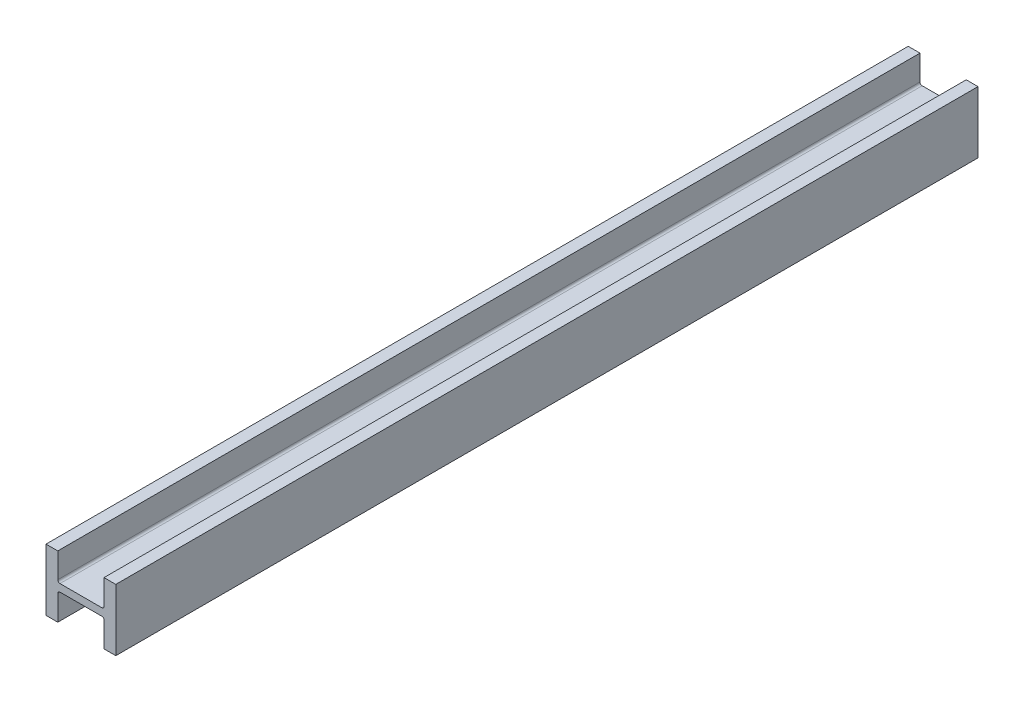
ISO-10303-21;
HEADER;
FILE_DESCRIPTION(('STEP AP214'),'2;1');
FILE_NAME('part.step','',(''),(''),'','','');
FILE_SCHEMA(('AUTOMOTIVE_DESIGN { 1 0 10303 214 1 1 1 1 }'));
ENDSEC;
DATA;
#1=APPLICATION_CONTEXT('core data for automotive mechanical design processes');
#2=APPLICATION_PROTOCOL_DEFINITION('international standard','automotive_design',2000,#1);
#3=PRODUCT_CONTEXT('',#1,'mechanical');
#4=PRODUCT('Part','Part','',(#3));
#5=PRODUCT_RELATED_PRODUCT_CATEGORY('part','',(#4));
#6=PRODUCT_DEFINITION_FORMATION('','',#4);
#7=PRODUCT_DEFINITION_CONTEXT('part definition',#1,'design');
#8=PRODUCT_DEFINITION('design','',#6,#7);
#9=PRODUCT_DEFINITION_SHAPE('','',#8);
#10=(LENGTH_UNIT() NAMED_UNIT(*) SI_UNIT(.MILLI.,.METRE.));
#11=(NAMED_UNIT(*) PLANE_ANGLE_UNIT() SI_UNIT($,.RADIAN.));
#12=(NAMED_UNIT(*) SI_UNIT($,.STERADIAN.) SOLID_ANGLE_UNIT());
#13=UNCERTAINTY_MEASURE_WITH_UNIT(LENGTH_MEASURE(1.E-05),#10,'distance_accuracy_value','');
#14=(GEOMETRIC_REPRESENTATION_CONTEXT(3) GLOBAL_UNCERTAINTY_ASSIGNED_CONTEXT((#13)) GLOBAL_UNIT_ASSIGNED_CONTEXT((#10,
#11,#12)) REPRESENTATION_CONTEXT('',''));
#15=CARTESIAN_POINT('',(0.,0.,0.));
#16=DIRECTION('',(0.,0.,1.));
#17=DIRECTION('',(1.,0.,0.));
#18=AXIS2_PLACEMENT_3D('',#15,#16,#17);
#19=CARTESIAN_POINT('',(241.554,213.8045,2984.5));
#20=DIRECTION('',(-1.,0.,0.));
#21=DIRECTION('',(0.,0.,1.));
#22=AXIS2_PLACEMENT_3D('',#19,#20,#21);
#23=PLANE('',#22);
#24=DIRECTION('',(0.,1.,0.));
#25=VECTOR('',#24,1.);
#26=CARTESIAN_POINT('',(241.554,213.8045,-2984.5));
#27=LINE('',#26,#25);
#28=CARTESIAN_POINT('',(241.554,-213.8045,-2984.5));
#29=VERTEX_POINT('',#28);
#30=CARTESIAN_POINT('',(241.554,213.8045,-2984.5));
#31=VERTEX_POINT('',#30);
#32=EDGE_CURVE('E192',#29,#31,#27,.T.);
#33=ORIENTED_EDGE('',*,*,#32,.T.);
#34=DIRECTION('',(0.,0.,-1.));
#35=VECTOR('',#34,1.);
#36=CARTESIAN_POINT('',(241.554,213.8045,2984.5));
#37=LINE('',#36,#35);
#38=CARTESIAN_POINT('',(241.554,213.8045,2984.5));
#39=VERTEX_POINT('',#38);
#40=EDGE_CURVE('E11',#39,#31,#37,.T.);
#41=ORIENTED_EDGE('',*,*,#40,.F.);
#42=DIRECTION('',(0.,1.,0.));
#43=VECTOR('',#42,1.);
#44=CARTESIAN_POINT('',(241.554,213.8045,2984.5));
#45=LINE('',#44,#43);
#46=CARTESIAN_POINT('',(241.554,-213.8045,2984.5));
#47=VERTEX_POINT('',#46);
#48=EDGE_CURVE('E238',#47,#39,#45,.T.);
#49=ORIENTED_EDGE('',*,*,#48,.F.);
#50=DIRECTION('',(0.,0.,-1.));
#51=VECTOR('',#50,1.);
#52=CARTESIAN_POINT('',(241.554,-213.8045,2984.5));
#53=LINE('',#52,#51);
#54=EDGE_CURVE('E186',#47,#29,#53,.T.);
#55=ORIENTED_EDGE('',*,*,#54,.T.);
#56=EDGE_LOOP('',(#33,#41,#49,#55));
#57=FACE_BOUND('',#56,.T.);
#58=ADVANCED_FACE('F44',(#57),#23,.F.);
#59=CARTESIAN_POINT('',(160.02,213.8045,2984.5));
#60=DIRECTION('',(0.,-1.,0.));
#61=DIRECTION('',(0.,0.,-1.));
#62=AXIS2_PLACEMENT_3D('',#59,#60,#61);
#63=PLANE('',#62);
#64=DIRECTION('',(-1.,0.,0.));
#65=VECTOR('',#64,1.);
#66=CARTESIAN_POINT('',(160.02,213.8045,-2984.5));
#67=LINE('',#66,#65);
#68=CARTESIAN_POINT('',(160.02,213.8045,-2984.5));
#69=VERTEX_POINT('',#68);
#70=EDGE_CURVE('E196',#31,#69,#67,.T.);
#71=ORIENTED_EDGE('',*,*,#70,.T.);
#72=DIRECTION('',(0.,0.,-1.));
#73=VECTOR('',#72,1.);
#74=CARTESIAN_POINT('',(160.02,213.8045,2984.5));
#75=LINE('',#74,#73);
#76=CARTESIAN_POINT('',(160.02,213.8045,2984.5));
#77=VERTEX_POINT('',#76);
#78=EDGE_CURVE('E53',#77,#69,#75,.T.);
#79=ORIENTED_EDGE('',*,*,#78,.F.);
#80=DIRECTION('',(-1.,0.,0.));
#81=VECTOR('',#80,1.);
#82=CARTESIAN_POINT('',(160.02,213.8045,2984.5));
#83=LINE('',#82,#81);
#84=EDGE_CURVE('E129',#39,#77,#83,.T.);
#85=ORIENTED_EDGE('',*,*,#84,.F.);
#86=ORIENTED_EDGE('',*,*,#40,.T.);
#87=EDGE_LOOP('',(#71,#79,#85,#86));
#88=FACE_BOUND('',#87,.T.);
#89=ADVANCED_FACE('F362',(#88),#63,.F.);
#90=CARTESIAN_POINT('',(160.02,40.8305000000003,2984.5));
#91=DIRECTION('',(1.,0.,0.));
#92=DIRECTION('',(0.,0.,-1.));
#93=AXIS2_PLACEMENT_3D('',#90,#91,#92);
#94=PLANE('',#93);
#95=DIRECTION('',(0.,-1.,0.));
#96=VECTOR('',#95,1.);
#97=CARTESIAN_POINT('',(160.02,40.8305000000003,-2984.5));
#98=LINE('',#97,#96);
#99=CARTESIAN_POINT('',(160.02,40.8305000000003,-2984.5));
#100=VERTEX_POINT('',#99);
#101=EDGE_CURVE('E203',#69,#100,#98,.T.);
#102=ORIENTED_EDGE('',*,*,#101,.T.);
#103=DIRECTION('',(0.,0.,-1.));
#104=VECTOR('',#103,1.);
#105=CARTESIAN_POINT('',(160.02,40.8305000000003,2984.5));
#106=LINE('',#105,#104);
#107=CARTESIAN_POINT('',(160.02,40.8305000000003,2984.5));
#108=VERTEX_POINT('',#107);
#109=EDGE_CURVE('E282',#108,#100,#106,.T.);
#110=ORIENTED_EDGE('',*,*,#109,.F.);
#111=DIRECTION('',(0.,-1.,0.));
#112=VECTOR('',#111,1.);
#113=CARTESIAN_POINT('',(160.02,40.8305000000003,2984.5));
#114=LINE('',#113,#112);
#115=EDGE_CURVE('E291',#77,#108,#114,.T.);
#116=ORIENTED_EDGE('',*,*,#115,.F.);
#117=ORIENTED_EDGE('',*,*,#78,.T.);
#118=EDGE_LOOP('',(#102,#110,#116,#117));
#119=FACE_BOUND('',#118,.T.);
#120=ADVANCED_FACE('F292',(#119),#94,.F.);
#121=CARTESIAN_POINT('',(144.78,40.8305000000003,2984.5));
#122=DIRECTION('',(0.,0.,-1.));
#123=DIRECTION('',(-1.,0.,0.));
#124=AXIS2_PLACEMENT_3D('',#121,#122,#123);
#125=CYLINDRICAL_SURFACE('',#124,15.24);
#126=CARTESIAN_POINT('',(144.78,40.8305000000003,-2984.5));
#127=DIRECTION('',(0.,0.,-1.));
#128=DIRECTION('',(1.,0.,0.));
#129=AXIS2_PLACEMENT_3D('',#126,#127,#128);
#130=CIRCLE('',#129,15.24);
#131=CARTESIAN_POINT('',(144.78,25.5905000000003,-2984.5));
#132=VERTEX_POINT('',#131);
#133=EDGE_CURVE('E204',#100,#132,#130,.T.);
#134=ORIENTED_EDGE('',*,*,#133,.T.);
#135=DIRECTION('',(0.,0.,-1.));
#136=VECTOR('',#135,1.);
#137=CARTESIAN_POINT('',(144.78,25.5905000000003,2984.5));
#138=LINE('',#137,#136);
#139=CARTESIAN_POINT('',(144.78,25.5905000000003,2984.5));
#140=VERTEX_POINT('',#139);
#141=EDGE_CURVE('E276',#140,#132,#138,.T.);
#142=ORIENTED_EDGE('',*,*,#141,.F.);
#143=CARTESIAN_POINT('',(144.78,40.8305000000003,2984.5));
#144=DIRECTION('',(0.,0.,-1.));
#145=DIRECTION('',(1.,0.,0.));
#146=AXIS2_PLACEMENT_3D('',#143,#144,#145);
#147=CIRCLE('',#146,15.24);
#148=EDGE_CURVE('E315',#108,#140,#147,.T.);
#149=ORIENTED_EDGE('',*,*,#148,.F.);
#150=ORIENTED_EDGE('',*,*,#109,.T.);
#151=EDGE_LOOP('',(#134,#142,#149,#150));
#152=FACE_BOUND('',#151,.T.);
#153=ADVANCED_FACE('F305',(#152),#125,.F.);
#154=CARTESIAN_POINT('',(-144.78,25.5905000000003,2984.5));
#155=DIRECTION('',(0.,-1.,0.));
#156=DIRECTION('',(1.,0.,0.));
#157=AXIS2_PLACEMENT_3D('',#154,#155,#156);
#158=PLANE('',#157);
#159=DIRECTION('',(-1.,0.,0.));
#160=VECTOR('',#159,1.);
#161=CARTESIAN_POINT('',(-144.78,25.5905000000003,-2984.5));
#162=LINE('',#161,#160);
#163=CARTESIAN_POINT('',(-144.78,25.5905000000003,-2984.5));
#164=VERTEX_POINT('',#163);
#165=EDGE_CURVE('E210',#132,#164,#162,.T.);
#166=ORIENTED_EDGE('',*,*,#165,.T.);
#167=DIRECTION('',(0.,0.,-1.));
#168=VECTOR('',#167,1.);
#169=CARTESIAN_POINT('',(-144.78,25.5905000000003,2984.5));
#170=LINE('',#169,#168);
#171=CARTESIAN_POINT('',(-144.78,25.5905000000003,2984.5));
#172=VERTEX_POINT('',#171);
#173=EDGE_CURVE('E274',#172,#164,#170,.T.);
#174=ORIENTED_EDGE('',*,*,#173,.F.);
#175=DIRECTION('',(-1.,0.,0.));
#176=VECTOR('',#175,1.);
#177=CARTESIAN_POINT('',(-144.78,25.5905000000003,2984.5));
#178=LINE('',#177,#176);
#179=EDGE_CURVE('E306',#140,#172,#178,.T.);
#180=ORIENTED_EDGE('',*,*,#179,.F.);
#181=ORIENTED_EDGE('',*,*,#141,.T.);
#182=EDGE_LOOP('',(#166,#174,#180,#181));
#183=FACE_BOUND('',#182,.T.);
#184=ADVANCED_FACE('F308',(#183),#158,.F.);
#185=CARTESIAN_POINT('',(-144.78,40.8305000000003,2984.5));
#186=DIRECTION('',(0.,0.,-1.));
#187=DIRECTION('',(-1.,0.,0.));
#188=AXIS2_PLACEMENT_3D('',#185,#186,#187);
#189=CYLINDRICAL_SURFACE('',#188,15.24);
#190=CARTESIAN_POINT('',(-144.78,40.8305000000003,-2984.5));
#191=DIRECTION('',(0.,0.,-1.));
#192=DIRECTION('',(1.,0.,0.));
#193=AXIS2_PLACEMENT_3D('',#190,#191,#192);
#194=CIRCLE('',#193,15.24);
#195=CARTESIAN_POINT('',(-160.02,40.8305000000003,-2984.5));
#196=VERTEX_POINT('',#195);
#197=EDGE_CURVE('E209',#164,#196,#194,.T.);
#198=ORIENTED_EDGE('',*,*,#197,.T.);
#199=DIRECTION('',(0.,0.,-1.));
#200=VECTOR('',#199,1.);
#201=CARTESIAN_POINT('',(-160.02,40.8305000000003,2984.5));
#202=LINE('',#201,#200);
#203=CARTESIAN_POINT('',(-160.02,40.8305000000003,2984.5));
#204=VERTEX_POINT('',#203);
#205=EDGE_CURVE('E271',#204,#196,#202,.T.);
#206=ORIENTED_EDGE('',*,*,#205,.F.);
#207=CARTESIAN_POINT('',(-144.78,40.8305000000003,2984.5));
#208=DIRECTION('',(0.,0.,-1.));
#209=DIRECTION('',(1.,0.,0.));
#210=AXIS2_PLACEMENT_3D('',#207,#208,#209);
#211=CIRCLE('',#210,15.24);
#212=EDGE_CURVE('E313',#172,#204,#211,.T.);
#213=ORIENTED_EDGE('',*,*,#212,.F.);
#214=ORIENTED_EDGE('',*,*,#173,.T.);
#215=EDGE_LOOP('',(#198,#206,#213,#214));
#216=FACE_BOUND('',#215,.T.);
#217=ADVANCED_FACE('F374',(#216),#189,.F.);
#218=CARTESIAN_POINT('',(-160.02,213.8045,2984.5));
#219=DIRECTION('',(-1.,0.,0.));
#220=DIRECTION('',(0.,0.,1.));
#221=AXIS2_PLACEMENT_3D('',#218,#219,#220);
#222=PLANE('',#221);
#223=DIRECTION('',(0.,1.,0.));
#224=VECTOR('',#223,1.);
#225=CARTESIAN_POINT('',(-160.02,213.8045,-2984.5));
#226=LINE('',#225,#224);
#227=CARTESIAN_POINT('',(-160.02,213.8045,-2984.5));
#228=VERTEX_POINT('',#227);
#229=EDGE_CURVE('E213',#196,#228,#226,.T.);
#230=ORIENTED_EDGE('',*,*,#229,.T.);
#231=DIRECTION('',(0.,0.,-1.));
#232=VECTOR('',#231,1.);
#233=CARTESIAN_POINT('',(-160.02,213.8045,2984.5));
#234=LINE('',#233,#232);
#235=CARTESIAN_POINT('',(-160.02,213.8045,2984.5));
#236=VERTEX_POINT('',#235);
#237=EDGE_CURVE('E270',#236,#228,#234,.T.);
#238=ORIENTED_EDGE('',*,*,#237,.F.);
#239=DIRECTION('',(0.,1.,0.));
#240=VECTOR('',#239,1.);
#241=CARTESIAN_POINT('',(-160.02,213.8045,2984.5));
#242=LINE('',#241,#240);
#243=EDGE_CURVE('E316',#204,#236,#242,.T.);
#244=ORIENTED_EDGE('',*,*,#243,.F.);
#245=ORIENTED_EDGE('',*,*,#205,.T.);
#246=EDGE_LOOP('',(#230,#238,#244,#245));
#247=FACE_BOUND('',#246,.T.);
#248=ADVANCED_FACE('F378',(#247),#222,.F.);
#249=CARTESIAN_POINT('',(-241.554,213.8045,2984.5));
#250=DIRECTION('',(0.,-1.,0.));
#251=DIRECTION('',(1.,0.,0.));
#252=AXIS2_PLACEMENT_3D('',#249,#250,#251);
#253=PLANE('',#252);
#254=DIRECTION('',(-1.,0.,0.));
#255=VECTOR('',#254,1.);
#256=CARTESIAN_POINT('',(-241.554,213.8045,-2984.5));
#257=LINE('',#256,#255);
#258=CARTESIAN_POINT('',(-241.554,213.8045,-2984.5));
#259=VERTEX_POINT('',#258);
#260=EDGE_CURVE('E216',#228,#259,#257,.T.);
#261=ORIENTED_EDGE('',*,*,#260,.T.);
#262=DIRECTION('',(0.,0.,-1.));
#263=VECTOR('',#262,1.);
#264=CARTESIAN_POINT('',(-241.554,213.8045,2984.5));
#265=LINE('',#264,#263);
#266=CARTESIAN_POINT('',(-241.554,213.8045,2984.5));
#267=VERTEX_POINT('',#266);
#268=EDGE_CURVE('E263',#267,#259,#265,.T.);
#269=ORIENTED_EDGE('',*,*,#268,.F.);
#270=DIRECTION('',(-1.,0.,0.));
#271=VECTOR('',#270,1.);
#272=CARTESIAN_POINT('',(-241.554,213.8045,2984.5));
#273=LINE('',#272,#271);
#274=EDGE_CURVE('E323',#236,#267,#273,.T.);
#275=ORIENTED_EDGE('',*,*,#274,.F.);
#276=ORIENTED_EDGE('',*,*,#237,.T.);
#277=EDGE_LOOP('',(#261,#269,#275,#276));
#278=FACE_BOUND('',#277,.T.);
#279=ADVANCED_FACE('F385',(#278),#253,.F.);
#280=CARTESIAN_POINT('',(-241.554,-213.8045,2984.5));
#281=DIRECTION('',(1.,0.,0.));
#282=DIRECTION('',(0.,0.,-1.));
#283=AXIS2_PLACEMENT_3D('',#280,#281,#282);
#284=PLANE('',#283);
#285=DIRECTION('',(0.,-1.,0.));
#286=VECTOR('',#285,1.);
#287=CARTESIAN_POINT('',(-241.554,-213.8045,-2984.5));
#288=LINE('',#287,#286);
#289=CARTESIAN_POINT('',(-241.554,-213.8045,-2984.5));
#290=VERTEX_POINT('',#289);
#291=EDGE_CURVE('E218',#259,#290,#288,.T.);
#292=ORIENTED_EDGE('',*,*,#291,.T.);
#293=DIRECTION('',(0.,0.,-1.));
#294=VECTOR('',#293,1.);
#295=CARTESIAN_POINT('',(-241.554,-213.8045,2984.5));
#296=LINE('',#295,#294);
#297=CARTESIAN_POINT('',(-241.554,-213.8045,2984.5));
#298=VERTEX_POINT('',#297);
#299=EDGE_CURVE('E259',#298,#290,#296,.T.);
#300=ORIENTED_EDGE('',*,*,#299,.F.);
#301=DIRECTION('',(0.,-1.,0.));
#302=VECTOR('',#301,1.);
#303=CARTESIAN_POINT('',(-241.554,-213.8045,2984.5));
#304=LINE('',#303,#302);
#305=EDGE_CURVE('E326',#267,#298,#304,.T.);
#306=ORIENTED_EDGE('',*,*,#305,.F.);
#307=ORIENTED_EDGE('',*,*,#268,.T.);
#308=EDGE_LOOP('',(#292,#300,#306,#307));
#309=FACE_BOUND('',#308,.T.);
#310=ADVANCED_FACE('F387',(#309),#284,.F.);
#311=CARTESIAN_POINT('',(-160.02,-213.8045,2984.5));
#312=DIRECTION('',(0.,1.,0.));
#313=DIRECTION('',(0.,0.,1.));
#314=AXIS2_PLACEMENT_3D('',#311,#312,#313);
#315=PLANE('',#314);
#316=DIRECTION('',(1.,0.,0.));
#317=VECTOR('',#316,1.);
#318=CARTESIAN_POINT('',(-160.02,-213.8045,-2984.5));
#319=LINE('',#318,#317);
#320=CARTESIAN_POINT('',(-160.02,-213.8045,-2984.5));
#321=VERTEX_POINT('',#320);
#322=EDGE_CURVE('E225',#290,#321,#319,.T.);
#323=ORIENTED_EDGE('',*,*,#322,.T.);
#324=DIRECTION('',(0.,0.,-1.));
#325=VECTOR('',#324,1.);
#326=CARTESIAN_POINT('',(-160.02,-213.8045,2984.5));
#327=LINE('',#326,#325);
#328=CARTESIAN_POINT('',(-160.02,-213.8045,2984.5));
#329=VERTEX_POINT('',#328);
#330=EDGE_CURVE('E254',#329,#321,#327,.T.);
#331=ORIENTED_EDGE('',*,*,#330,.F.);
#332=DIRECTION('',(1.,0.,0.));
#333=VECTOR('',#332,1.);
#334=CARTESIAN_POINT('',(-160.02,-213.8045,2984.5));
#335=LINE('',#334,#333);
#336=EDGE_CURVE('E328',#298,#329,#335,.T.);
#337=ORIENTED_EDGE('',*,*,#336,.F.);
#338=ORIENTED_EDGE('',*,*,#299,.T.);
#339=EDGE_LOOP('',(#323,#331,#337,#338));
#340=FACE_BOUND('',#339,.T.);
#341=ADVANCED_FACE('F388',(#340),#315,.F.);
#342=CARTESIAN_POINT('',(-160.02,-40.8304999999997,2984.5));
#343=DIRECTION('',(-1.,0.,0.));
#344=DIRECTION('',(0.,0.,1.));
#345=AXIS2_PLACEMENT_3D('',#342,#343,#344);
#346=PLANE('',#345);
#347=DIRECTION('',(0.,1.,0.));
#348=VECTOR('',#347,1.);
#349=CARTESIAN_POINT('',(-160.02,-40.8304999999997,-2984.5));
#350=LINE('',#349,#348);
#351=CARTESIAN_POINT('',(-160.02,-40.8304999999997,-2984.5));
#352=VERTEX_POINT('',#351);
#353=EDGE_CURVE('E223',#321,#352,#350,.T.);
#354=ORIENTED_EDGE('',*,*,#353,.T.);
#355=DIRECTION('',(0.,0.,-1.));
#356=VECTOR('',#355,1.);
#357=CARTESIAN_POINT('',(-160.02,-40.8304999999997,2984.5));
#358=LINE('',#357,#356);
#359=CARTESIAN_POINT('',(-160.02,-40.8304999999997,2984.5));
#360=VERTEX_POINT('',#359);
#361=EDGE_CURVE('E253',#360,#352,#358,.T.);
#362=ORIENTED_EDGE('',*,*,#361,.F.);
#363=DIRECTION('',(0.,1.,0.));
#364=VECTOR('',#363,1.);
#365=CARTESIAN_POINT('',(-160.02,-40.8304999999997,2984.5));
#366=LINE('',#365,#364);
#367=EDGE_CURVE('E335',#329,#360,#366,.T.);
#368=ORIENTED_EDGE('',*,*,#367,.F.);
#369=ORIENTED_EDGE('',*,*,#330,.T.);
#370=EDGE_LOOP('',(#354,#362,#368,#369));
#371=FACE_BOUND('',#370,.T.);
#372=ADVANCED_FACE('F395',(#371),#346,.F.);
#373=CARTESIAN_POINT('',(-144.78,-40.8304999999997,2984.5));
#374=DIRECTION('',(0.,0.,-1.));
#375=DIRECTION('',(-1.,0.,0.));
#376=AXIS2_PLACEMENT_3D('',#373,#374,#375);
#377=CYLINDRICAL_SURFACE('',#376,15.24);
#378=CARTESIAN_POINT('',(-144.78,-40.8304999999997,-2984.5));
#379=DIRECTION('',(0.,0.,-1.));
#380=DIRECTION('',(1.,0.,0.));
#381=AXIS2_PLACEMENT_3D('',#378,#379,#380);
#382=CIRCLE('',#381,15.24);
#383=CARTESIAN_POINT('',(-144.78,-25.5904999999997,-2984.5));
#384=VERTEX_POINT('',#383);
#385=EDGE_CURVE('E227',#352,#384,#382,.T.);
#386=ORIENTED_EDGE('',*,*,#385,.T.);
#387=DIRECTION('',(0.,0.,-1.));
#388=VECTOR('',#387,1.);
#389=CARTESIAN_POINT('',(-144.78,-25.5904999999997,2984.5));
#390=LINE('',#389,#388);
#391=CARTESIAN_POINT('',(-144.78,-25.5904999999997,2984.5));
#392=VERTEX_POINT('',#391);
#393=EDGE_CURVE('E250',#392,#384,#390,.T.);
#394=ORIENTED_EDGE('',*,*,#393,.F.);
#395=CARTESIAN_POINT('',(-144.78,-40.8304999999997,2984.5));
#396=DIRECTION('',(0.,0.,-1.));
#397=DIRECTION('',(1.,0.,0.));
#398=AXIS2_PLACEMENT_3D('',#395,#396,#397);
#399=CIRCLE('',#398,15.24);
#400=EDGE_CURVE('E333',#360,#392,#399,.T.);
#401=ORIENTED_EDGE('',*,*,#400,.F.);
#402=ORIENTED_EDGE('',*,*,#361,.T.);
#403=EDGE_LOOP('',(#386,#394,#401,#402));
#404=FACE_BOUND('',#403,.T.);
#405=ADVANCED_FACE('F341',(#404),#377,.F.);
#406=CARTESIAN_POINT('',(144.78,-25.5904999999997,2984.5));
#407=DIRECTION('',(0.,1.,0.));
#408=DIRECTION('',(-1.,0.,0.));
#409=AXIS2_PLACEMENT_3D('',#406,#407,#408);
#410=PLANE('',#409);
#411=DIRECTION('',(1.,0.,0.));
#412=VECTOR('',#411,1.);
#413=CARTESIAN_POINT('',(144.78,-25.5904999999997,-2984.5));
#414=LINE('',#413,#412);
#415=CARTESIAN_POINT('',(144.78,-25.5904999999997,-2984.5));
#416=VERTEX_POINT('',#415);
#417=EDGE_CURVE('E233',#384,#416,#414,.T.);
#418=ORIENTED_EDGE('',*,*,#417,.T.);
#419=DIRECTION('',(0.,0.,-1.));
#420=VECTOR('',#419,1.);
#421=CARTESIAN_POINT('',(144.78,-25.5904999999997,2984.5));
#422=LINE('',#421,#420);
#423=CARTESIAN_POINT('',(144.78,-25.5904999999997,2984.5));
#424=VERTEX_POINT('',#423);
#425=EDGE_CURVE('E181',#424,#416,#422,.T.);
#426=ORIENTED_EDGE('',*,*,#425,.F.);
#427=DIRECTION('',(1.,0.,0.));
#428=VECTOR('',#427,1.);
#429=CARTESIAN_POINT('',(144.78,-25.5904999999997,2984.5));
#430=LINE('',#429,#428);
#431=EDGE_CURVE('E174',#392,#424,#430,.T.);
#432=ORIENTED_EDGE('',*,*,#431,.F.);
#433=ORIENTED_EDGE('',*,*,#393,.T.);
#434=EDGE_LOOP('',(#418,#426,#432,#433));
#435=FACE_BOUND('',#434,.T.);
#436=ADVANCED_FACE('F350',(#435),#410,.F.);
#437=CARTESIAN_POINT('',(144.78,-40.8304999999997,2984.5));
#438=DIRECTION('',(0.,0.,-1.));
#439=DIRECTION('',(-1.,0.,0.));
#440=AXIS2_PLACEMENT_3D('',#437,#438,#439);
#441=CYLINDRICAL_SURFACE('',#440,15.24);
#442=CARTESIAN_POINT('',(144.78,-40.8304999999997,-2984.5));
#443=DIRECTION('',(0.,0.,-1.));
#444=DIRECTION('',(1.,0.,0.));
#445=AXIS2_PLACEMENT_3D('',#442,#443,#444);
#446=CIRCLE('',#445,15.24);
#447=CARTESIAN_POINT('',(160.02,-40.8304999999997,-2984.5));
#448=VERTEX_POINT('',#447);
#449=EDGE_CURVE('E182',#416,#448,#446,.T.);
#450=ORIENTED_EDGE('',*,*,#449,.T.);
#451=DIRECTION('',(0.,0.,-1.));
#452=VECTOR('',#451,1.);
#453=CARTESIAN_POINT('',(160.02,-40.8304999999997,2984.5));
#454=LINE('',#453,#452);
#455=CARTESIAN_POINT('',(160.02,-40.8304999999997,2984.5));
#456=VERTEX_POINT('',#455);
#457=EDGE_CURVE('E176',#456,#448,#454,.T.);
#458=ORIENTED_EDGE('',*,*,#457,.F.);
#459=CARTESIAN_POINT('',(144.78,-40.8304999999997,2984.5));
#460=DIRECTION('',(0.,0.,-1.));
#461=DIRECTION('',(1.,0.,0.));
#462=AXIS2_PLACEMENT_3D('',#459,#460,#461);
#463=CIRCLE('',#462,15.24);
#464=EDGE_CURVE('E167',#424,#456,#463,.T.);
#465=ORIENTED_EDGE('',*,*,#464,.F.);
#466=ORIENTED_EDGE('',*,*,#425,.T.);
#467=EDGE_LOOP('',(#450,#458,#465,#466));
#468=FACE_BOUND('',#467,.T.);
#469=ADVANCED_FACE('F177',(#468),#441,.F.);
#470=CARTESIAN_POINT('',(160.02,-213.8045,2984.5));
#471=DIRECTION('',(1.,0.,0.));
#472=DIRECTION('',(0.,0.,-1.));
#473=AXIS2_PLACEMENT_3D('',#470,#471,#472);
#474=PLANE('',#473);
#475=DIRECTION('',(0.,-1.,0.));
#476=VECTOR('',#475,1.);
#477=CARTESIAN_POINT('',(160.02,-213.8045,-2984.5));
#478=LINE('',#477,#476);
#479=CARTESIAN_POINT('',(160.02,-213.8045,-2984.5));
#480=VERTEX_POINT('',#479);
#481=EDGE_CURVE('E113',#448,#480,#478,.T.);
#482=ORIENTED_EDGE('',*,*,#481,.T.);
#483=DIRECTION('',(0.,0.,-1.));
#484=VECTOR('',#483,1.);
#485=CARTESIAN_POINT('',(160.02,-213.8045,2984.5));
#486=LINE('',#485,#484);
#487=CARTESIAN_POINT('',(160.02,-213.8045,2984.5));
#488=VERTEX_POINT('',#487);
#489=EDGE_CURVE('E184',#488,#480,#486,.T.);
#490=ORIENTED_EDGE('',*,*,#489,.F.);
#491=DIRECTION('',(0.,-1.,0.));
#492=VECTOR('',#491,1.);
#493=CARTESIAN_POINT('',(160.02,-213.8045,2984.5));
#494=LINE('',#493,#492);
#495=EDGE_CURVE('E168',#456,#488,#494,.T.);
#496=ORIENTED_EDGE('',*,*,#495,.F.);
#497=ORIENTED_EDGE('',*,*,#457,.T.);
#498=EDGE_LOOP('',(#482,#490,#496,#497));
#499=FACE_BOUND('',#498,.T.);
#500=ADVANCED_FACE('F188',(#499),#474,.F.);
#501=CARTESIAN_POINT('',(241.554,-213.8045,2984.5));
#502=DIRECTION('',(0.,1.,0.));
#503=DIRECTION('',(-1.,0.,0.));
#504=AXIS2_PLACEMENT_3D('',#501,#502,#503);
#505=PLANE('',#504);
#506=DIRECTION('',(1.,0.,0.));
#507=VECTOR('',#506,1.);
#508=CARTESIAN_POINT('',(241.554,-213.8045,-2984.5));
#509=LINE('',#508,#507);
#510=EDGE_CURVE('E123',#480,#29,#509,.T.);
#511=ORIENTED_EDGE('',*,*,#510,.T.);
#512=ORIENTED_EDGE('',*,*,#54,.F.);
#513=DIRECTION('',(1.,0.,0.));
#514=VECTOR('',#513,1.);
#515=CARTESIAN_POINT('',(241.554,-213.8045,2984.5));
#516=LINE('',#515,#514);
#517=EDGE_CURVE('E64',#488,#47,#516,.T.);
#518=ORIENTED_EDGE('',*,*,#517,.F.);
#519=ORIENTED_EDGE('',*,*,#489,.T.);
#520=EDGE_LOOP('',(#511,#512,#518,#519));
#521=FACE_BOUND('',#520,.T.);
#522=ADVANCED_FACE('F353',(#521),#505,.F.);
#523=CARTESIAN_POINT('',(144.78,-40.8304999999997,2984.5));
#524=DIRECTION('',(0.,0.,1.));
#525=DIRECTION('',(1.,0.,0.));
#526=AXIS2_PLACEMENT_3D('',#523,#524,#525);
#527=PLANE('',#526);
#528=ORIENTED_EDGE('',*,*,#48,.T.);
#529=ORIENTED_EDGE('',*,*,#84,.T.);
#530=ORIENTED_EDGE('',*,*,#115,.T.);
#531=ORIENTED_EDGE('',*,*,#148,.T.);
#532=ORIENTED_EDGE('',*,*,#179,.T.);
#533=ORIENTED_EDGE('',*,*,#212,.T.);
#534=ORIENTED_EDGE('',*,*,#243,.T.);
#535=ORIENTED_EDGE('',*,*,#274,.T.);
#536=ORIENTED_EDGE('',*,*,#305,.T.);
#537=ORIENTED_EDGE('',*,*,#336,.T.);
#538=ORIENTED_EDGE('',*,*,#367,.T.);
#539=ORIENTED_EDGE('',*,*,#400,.T.);
#540=ORIENTED_EDGE('',*,*,#431,.T.);
#541=ORIENTED_EDGE('',*,*,#464,.T.);
#542=ORIENTED_EDGE('',*,*,#495,.T.);
#543=ORIENTED_EDGE('',*,*,#517,.T.);
#544=EDGE_LOOP('',(#528,#529,#530,#531,#532,#533,#534,#535,#536,#537,#538,#539,#540,#541,#542,#543));
#545=FACE_BOUND('',#544,.T.);
#546=ADVANCED_FACE('F169',(#545),#527,.T.);
#547=CARTESIAN_POINT('',(144.78,-40.8304999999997,-2984.5));
#548=DIRECTION('',(0.,0.,1.));
#549=DIRECTION('',(1.,0.,0.));
#550=AXIS2_PLACEMENT_3D('',#547,#548,#549);
#551=PLANE('',#550);
#552=ORIENTED_EDGE('',*,*,#32,.F.);
#553=ORIENTED_EDGE('',*,*,#510,.F.);
#554=ORIENTED_EDGE('',*,*,#481,.F.);
#555=ORIENTED_EDGE('',*,*,#449,.F.);
#556=ORIENTED_EDGE('',*,*,#417,.F.);
#557=ORIENTED_EDGE('',*,*,#385,.F.);
#558=ORIENTED_EDGE('',*,*,#353,.F.);
#559=ORIENTED_EDGE('',*,*,#322,.F.);
#560=ORIENTED_EDGE('',*,*,#291,.F.);
#561=ORIENTED_EDGE('',*,*,#260,.F.);
#562=ORIENTED_EDGE('',*,*,#229,.F.);
#563=ORIENTED_EDGE('',*,*,#197,.F.);
#564=ORIENTED_EDGE('',*,*,#165,.F.);
#565=ORIENTED_EDGE('',*,*,#133,.F.);
#566=ORIENTED_EDGE('',*,*,#101,.F.);
#567=ORIENTED_EDGE('',*,*,#70,.F.);
#568=EDGE_LOOP('',(#552,#553,#554,#555,#556,#557,#558,#559,#560,#561,#562,#563,#564,#565,#566,#567));
#569=FACE_BOUND('',#568,.T.);
#570=ADVANCED_FACE('F299',(#569),#551,.F.);
#571=CLOSED_SHELL('',(#58,#89,#120,#153,#184,#217,#248,#279,#310,#341,#372,#405,#436,#469,#500,
#522,#546,#570));
#572=MANIFOLD_SOLID_BREP('B2',#571);
#573=ADVANCED_BREP_SHAPE_REPRESENTATION('',(#18,#572),#14);
#574=SHAPE_DEFINITION_REPRESENTATION(#9,#573);
ENDSEC;
END-ISO-10303-21;
